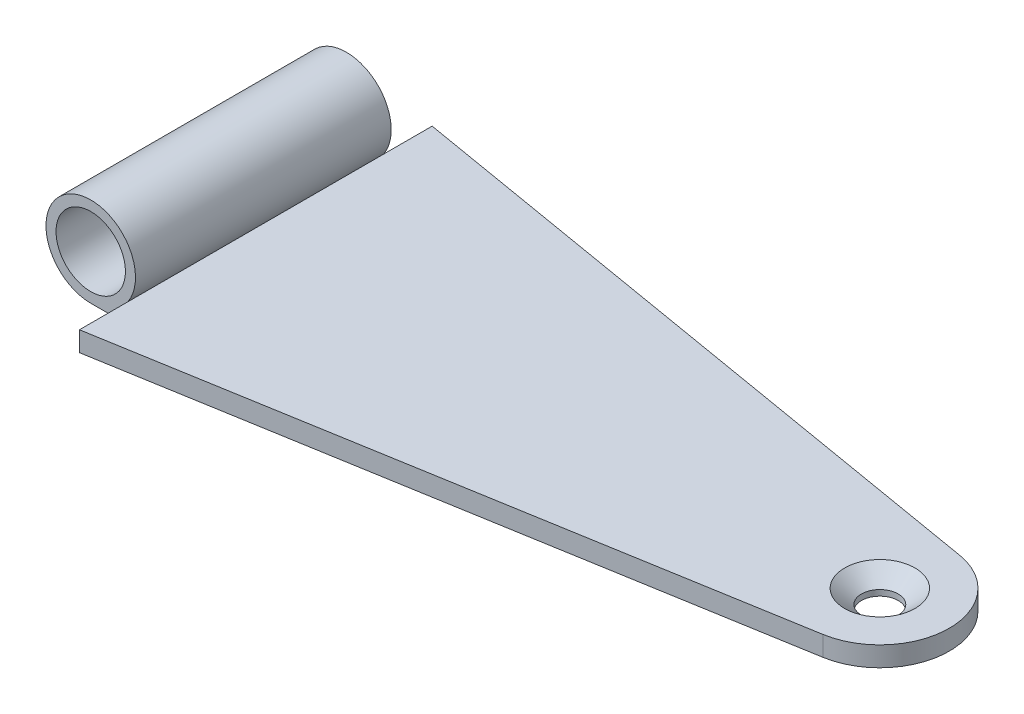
ISO-10303-21;
HEADER;
FILE_DESCRIPTION(('STEP AP214'),'2;1');
FILE_NAME('part.step','',(''),(''),'','','');
FILE_SCHEMA(('AUTOMOTIVE_DESIGN { 1 0 10303 214 1 1 1 1 }'));
ENDSEC;
DATA;
#1=APPLICATION_CONTEXT('core data for automotive mechanical design processes');
#2=APPLICATION_PROTOCOL_DEFINITION('international standard','automotive_design',2000,#1);
#3=PRODUCT_CONTEXT('',#1,'mechanical');
#4=PRODUCT('Part','Part','',(#3));
#5=PRODUCT_RELATED_PRODUCT_CATEGORY('part','',(#4));
#6=PRODUCT_DEFINITION_FORMATION('','',#4);
#7=PRODUCT_DEFINITION_CONTEXT('part definition',#1,'design');
#8=PRODUCT_DEFINITION('design','',#6,#7);
#9=PRODUCT_DEFINITION_SHAPE('','',#8);
#10=(LENGTH_UNIT() NAMED_UNIT(*) SI_UNIT(.MILLI.,.METRE.));
#11=(NAMED_UNIT(*) PLANE_ANGLE_UNIT() SI_UNIT($,.RADIAN.));
#12=(NAMED_UNIT(*) SI_UNIT($,.STERADIAN.) SOLID_ANGLE_UNIT());
#13=UNCERTAINTY_MEASURE_WITH_UNIT(LENGTH_MEASURE(1.E-05),#10,'distance_accuracy_value','');
#14=(GEOMETRIC_REPRESENTATION_CONTEXT(3) GLOBAL_UNCERTAINTY_ASSIGNED_CONTEXT((#13)) GLOBAL_UNIT_ASSIGNED_CONTEXT((#10,
#11,#12)) REPRESENTATION_CONTEXT('',''));
#15=CARTESIAN_POINT('',(0.,0.,0.));
#16=DIRECTION('',(0.,0.,1.));
#17=DIRECTION('',(1.,0.,0.));
#18=AXIS2_PLACEMENT_3D('',#15,#16,#17);
#19=CARTESIAN_POINT('',(91.948,0.,0.));
#20=DIRECTION('',(0.,-1.,0.));
#21=DIRECTION('',(0.,0.,-1.));
#22=AXIS2_PLACEMENT_3D('',#19,#20,#21);
#23=PLANE('',#22);
#24=CARTESIAN_POINT('',(91.948,0.,0.));
#25=DIRECTION('',(0.,1.,0.));
#26=DIRECTION('',(0.,0.,1.));
#27=AXIS2_PLACEMENT_3D('',#24,#25,#26);
#28=CIRCLE('',#27,4.88950000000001);
#29=CARTESIAN_POINT('',(91.948,0.,4.8895));
#30=VERTEX_POINT('',#29);
#31=EDGE_CURVE('E182',#30,#30,#28,.T.);
#32=ORIENTED_EDGE('',*,*,#31,.F.);
#33=EDGE_LOOP('',(#32));
#34=FACE_BOUND('',#33,.T.);
#35=DIRECTION('',(0.,0.,1.));
#36=VECTOR('',#35,1.);
#37=CARTESIAN_POINT('',(5.17177029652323,0.,-17.78));
#38=LINE('',#37,#36);
#39=CARTESIAN_POINT('',(5.17177029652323,0.,-17.78));
#40=VERTEX_POINT('',#39);
#41=CARTESIAN_POINT('',(5.17177029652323,0.,17.78));
#42=VERTEX_POINT('',#41);
#43=EDGE_CURVE('E49',#40,#42,#38,.T.);
#44=ORIENTED_EDGE('',*,*,#43,.T.);
#45=DIRECTION('',(0.,0.,-1.));
#46=VECTOR('',#45,1.);
#47=CARTESIAN_POINT('',(5.17177029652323,0.,17.78));
#48=LINE('',#47,#46);
#49=CARTESIAN_POINT('',(5.17177029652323,0.,24.521995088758));
#50=VERTEX_POINT('',#49);
#51=EDGE_CURVE('E122',#50,#42,#48,.T.);
#52=ORIENTED_EDGE('',*,*,#51,.F.);
#53=DIRECTION('',(0.985893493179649,0.,-0.16737389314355));
#54=VECTOR('',#53,1.);
#55=CARTESIAN_POINT('',(0.,0.,25.4));
#56=LINE('',#55,#54);
#57=CARTESIAN_POINT('',(93.5634928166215,0.,9.51584399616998));
#58=VERTEX_POINT('',#57);
#59=EDGE_CURVE('E69',#50,#58,#56,.T.);
#60=ORIENTED_EDGE('',*,*,#59,.T.);
#61=CARTESIAN_POINT('',(91.948,0.,0.));
#62=DIRECTION('',(0.,1.,0.));
#63=DIRECTION('',(0.,0.,-1.));
#64=AXIS2_PLACEMENT_3D('',#61,#62,#63);
#65=CIRCLE('',#64,9.65200000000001);
#66=CARTESIAN_POINT('',(93.5634928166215,0.,-9.51584399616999));
#67=VERTEX_POINT('',#66);
#68=EDGE_CURVE('E137',#58,#67,#65,.T.);
#69=ORIENTED_EDGE('',*,*,#68,.T.);
#70=DIRECTION('',(-0.98589349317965,0.,-0.167373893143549));
#71=VECTOR('',#70,1.);
#72=CARTESIAN_POINT('',(93.5634928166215,0.,-9.51584399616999));
#73=LINE('',#72,#71);
#74=CARTESIAN_POINT('',(5.17177029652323,0.,-24.521995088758));
#75=VERTEX_POINT('',#74);
#76=EDGE_CURVE('E141',#67,#75,#73,.T.);
#77=ORIENTED_EDGE('',*,*,#76,.T.);
#78=DIRECTION('',(0.,0.,-1.));
#79=VECTOR('',#78,1.);
#80=CARTESIAN_POINT('',(5.17177029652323,0.,-24.521995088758));
#81=LINE('',#80,#79);
#82=EDGE_CURVE('E92',#40,#75,#81,.T.);
#83=ORIENTED_EDGE('',*,*,#82,.F.);
#84=EDGE_LOOP('',(#44,#52,#60,#69,#77,#83));
#85=FACE_BOUND('',#84,.T.);
#86=ADVANCED_FACE('F40',(#34,#85),#23,.F.);
#87=CARTESIAN_POINT('',(93.5634928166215,-2.762,-9.51584399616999));
#88=DIRECTION('',(0.167373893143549,0.,-0.98589349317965));
#89=DIRECTION('',(-0.98589349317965,0.,-0.167373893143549));
#90=AXIS2_PLACEMENT_3D('',#87,#88,#89);
#91=PLANE('',#90);
#92=DIRECTION('',(0.,1.,0.));
#93=VECTOR('',#92,1.);
#94=CARTESIAN_POINT('',(5.17177029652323,-2.762,-24.521995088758));
#95=LINE('',#94,#93);
#96=CARTESIAN_POINT('',(5.17177029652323,-2.762,-24.521995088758));
#97=VERTEX_POINT('',#96);
#98=EDGE_CURVE('E165',#97,#75,#95,.T.);
#99=ORIENTED_EDGE('',*,*,#98,.T.);
#100=ORIENTED_EDGE('',*,*,#76,.F.);
#101=DIRECTION('',(0.,1.,0.));
#102=VECTOR('',#101,1.);
#103=CARTESIAN_POINT('',(93.5634928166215,-2.762,-9.51584399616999));
#104=LINE('',#103,#102);
#105=CARTESIAN_POINT('',(93.5634928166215,-2.762,-9.51584399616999));
#106=VERTEX_POINT('',#105);
#107=EDGE_CURVE('E57',#106,#67,#104,.T.);
#108=ORIENTED_EDGE('',*,*,#107,.F.);
#109=DIRECTION('',(-0.98589349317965,0.,-0.167373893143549));
#110=VECTOR('',#109,1.);
#111=CARTESIAN_POINT('',(93.5634928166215,-2.762,-9.51584399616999));
#112=LINE('',#111,#110);
#113=EDGE_CURVE('E133',#106,#97,#112,.T.);
#114=ORIENTED_EDGE('',*,*,#113,.T.);
#115=EDGE_LOOP('',(#99,#100,#108,#114));
#116=FACE_BOUND('',#115,.T.);
#117=ADVANCED_FACE('F42',(#116),#91,.T.);
#118=CARTESIAN_POINT('',(91.948,-2.762,0.));
#119=DIRECTION('',(0.,1.,0.));
#120=DIRECTION('',(0.,0.,1.));
#121=AXIS2_PLACEMENT_3D('',#118,#119,#120);
#122=CYLINDRICAL_SURFACE('',#121,9.65200000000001);
#123=ORIENTED_EDGE('',*,*,#68,.F.);
#124=DIRECTION('',(0.,1.,0.));
#125=VECTOR('',#124,1.);
#126=CARTESIAN_POINT('',(93.5634928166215,-2.762,9.51584399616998));
#127=LINE('',#126,#125);
#128=CARTESIAN_POINT('',(93.5634928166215,-2.762,9.51584399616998));
#129=VERTEX_POINT('',#128);
#130=EDGE_CURVE('E135',#129,#58,#127,.T.);
#131=ORIENTED_EDGE('',*,*,#130,.F.);
#132=CARTESIAN_POINT('',(91.948,-2.762,0.));
#133=DIRECTION('',(0.,1.,0.));
#134=DIRECTION('',(0.,0.,-1.));
#135=AXIS2_PLACEMENT_3D('',#132,#133,#134);
#136=CIRCLE('',#135,9.65200000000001);
#137=EDGE_CURVE('E132',#129,#106,#136,.T.);
#138=ORIENTED_EDGE('',*,*,#137,.T.);
#139=ORIENTED_EDGE('',*,*,#107,.T.);
#140=EDGE_LOOP('',(#123,#131,#138,#139));
#141=FACE_BOUND('',#140,.T.);
#142=ADVANCED_FACE('F193',(#141),#122,.T.);
#143=CARTESIAN_POINT('',(0.,-2.762,25.4));
#144=DIRECTION('',(0.16737389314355,0.,0.98589349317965));
#145=DIRECTION('',(0.98589349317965,0.,-0.16737389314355));
#146=AXIS2_PLACEMENT_3D('',#143,#144,#145);
#147=PLANE('',#146);
#148=DIRECTION('',(0.,1.,0.));
#149=VECTOR('',#148,1.);
#150=CARTESIAN_POINT('',(5.17177029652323,-2.762,24.521995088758));
#151=LINE('',#150,#149);
#152=CARTESIAN_POINT('',(5.17177029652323,-2.762,24.521995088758));
#153=VERTEX_POINT('',#152);
#154=EDGE_CURVE('E116',#153,#50,#151,.T.);
#155=ORIENTED_EDGE('',*,*,#154,.F.);
#156=DIRECTION('',(0.985893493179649,0.,-0.16737389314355));
#157=VECTOR('',#156,1.);
#158=CARTESIAN_POINT('',(0.,-2.762,25.4));
#159=LINE('',#158,#157);
#160=EDGE_CURVE('E126',#153,#129,#159,.T.);
#161=ORIENTED_EDGE('',*,*,#160,.T.);
#162=ORIENTED_EDGE('',*,*,#130,.T.);
#163=ORIENTED_EDGE('',*,*,#59,.F.);
#164=EDGE_LOOP('',(#155,#161,#162,#163));
#165=FACE_BOUND('',#164,.T.);
#166=ADVANCED_FACE('F125',(#165),#147,.T.);
#167=CARTESIAN_POINT('',(91.948,-2.762,0.));
#168=DIRECTION('',(0.,-1.,0.));
#169=DIRECTION('',(0.,0.,-1.));
#170=AXIS2_PLACEMENT_3D('',#167,#168,#169);
#171=PLANE('',#170);
#172=CARTESIAN_POINT('',(91.948,-2.762,0.));
#173=DIRECTION('',(0.,1.,0.));
#174=DIRECTION('',(0.,0.,1.));
#175=AXIS2_PLACEMENT_3D('',#172,#173,#174);
#176=CIRCLE('',#175,2.55270000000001);
#177=CARTESIAN_POINT('',(91.948,-2.762,2.5527));
#178=VERTEX_POINT('',#177);
#179=EDGE_CURVE('E175',#178,#178,#176,.T.);
#180=ORIENTED_EDGE('',*,*,#179,.T.);
#181=EDGE_LOOP('',(#180));
#182=FACE_BOUND('',#181,.T.);
#183=DIRECTION('',(-1.,0.,0.));
#184=VECTOR('',#183,1.);
#185=CARTESIAN_POINT('',(5.17177029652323,-2.762,17.78));
#186=LINE('',#185,#184);
#187=CARTESIAN_POINT('',(5.17177029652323,-2.762,17.78));
#188=VERTEX_POINT('',#187);
#189=CARTESIAN_POINT('',(0.,-2.762,17.78));
#190=VERTEX_POINT('',#189);
#191=EDGE_CURVE('E121',#188,#190,#186,.T.);
#192=ORIENTED_EDGE('',*,*,#191,.T.);
#193=DIRECTION('',(0.,0.,1.));
#194=VECTOR('',#193,1.);
#195=CARTESIAN_POINT('',(0.,-2.762,-17.78));
#196=LINE('',#195,#194);
#197=CARTESIAN_POINT('',(0.,-2.762,-17.78));
#198=VERTEX_POINT('',#197);
#199=EDGE_CURVE('E144',#198,#190,#196,.T.);
#200=ORIENTED_EDGE('',*,*,#199,.F.);
#201=DIRECTION('',(1.,0.,0.));
#202=VECTOR('',#201,1.);
#203=CARTESIAN_POINT('',(0.,-2.762,-17.78));
#204=LINE('',#203,#202);
#205=CARTESIAN_POINT('',(5.17177029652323,-2.762,-17.78));
#206=VERTEX_POINT('',#205);
#207=EDGE_CURVE('E78',#198,#206,#204,.T.);
#208=ORIENTED_EDGE('',*,*,#207,.T.);
#209=DIRECTION('',(0.,0.,-1.));
#210=VECTOR('',#209,1.);
#211=CARTESIAN_POINT('',(5.17177029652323,-2.762,-24.521995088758));
#212=LINE('',#211,#210);
#213=EDGE_CURVE('E167',#206,#97,#212,.T.);
#214=ORIENTED_EDGE('',*,*,#213,.T.);
#215=ORIENTED_EDGE('',*,*,#113,.F.);
#216=ORIENTED_EDGE('',*,*,#137,.F.);
#217=ORIENTED_EDGE('',*,*,#160,.F.);
#218=DIRECTION('',(0.,0.,-1.));
#219=VECTOR('',#218,1.);
#220=CARTESIAN_POINT('',(5.17177029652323,-2.762,17.78));
#221=LINE('',#220,#219);
#222=EDGE_CURVE('E112',#153,#188,#221,.T.);
#223=ORIENTED_EDGE('',*,*,#222,.T.);
#224=EDGE_LOOP('',(#192,#200,#208,#214,#215,#216,#217,#223));
#225=FACE_BOUND('',#224,.T.);
#226=ADVANCED_FACE('F130',(#182,#225),#171,.T.);
#227=CARTESIAN_POINT('',(0.,3.461,-17.78));
#228=DIRECTION('',(0.,0.,1.));
#229=DIRECTION('',(1.,0.,0.));
#230=AXIS2_PLACEMENT_3D('',#227,#228,#229);
#231=CYLINDRICAL_SURFACE('',#230,6.223);
#232=CARTESIAN_POINT('',(0.,3.461,-17.78));
#233=DIRECTION('',(0.,0.,1.));
#234=DIRECTION('',(1.,0.,0.));
#235=AXIS2_PLACEMENT_3D('',#232,#233,#234);
#236=CIRCLE('',#235,6.223);
#237=EDGE_CURVE('E154',#40,#198,#236,.T.);
#238=ORIENTED_EDGE('',*,*,#237,.T.);
#239=ORIENTED_EDGE('',*,*,#199,.T.);
#240=CARTESIAN_POINT('',(0.,3.461,17.78));
#241=DIRECTION('',(0.,0.,1.));
#242=DIRECTION('',(1.,0.,0.));
#243=AXIS2_PLACEMENT_3D('',#240,#241,#242);
#244=CIRCLE('',#243,6.223);
#245=EDGE_CURVE('E157',#42,#190,#244,.T.);
#246=ORIENTED_EDGE('',*,*,#245,.F.);
#247=ORIENTED_EDGE('',*,*,#43,.F.);
#248=EDGE_LOOP('',(#238,#239,#246,#247));
#249=FACE_BOUND('',#248,.T.);
#250=ADVANCED_FACE('F152',(#249),#231,.T.);
#251=CARTESIAN_POINT('',(0.,3.461,-17.78));
#252=DIRECTION('',(0.,0.,1.));
#253=DIRECTION('',(1.,0.,0.));
#254=AXIS2_PLACEMENT_3D('',#251,#252,#253);
#255=PLANE('',#254);
#256=CARTESIAN_POINT('',(0.,3.461,-17.78));
#257=DIRECTION('',(0.,0.,1.));
#258=DIRECTION('',(1.,0.,0.));
#259=AXIS2_PLACEMENT_3D('',#256,#257,#258);
#260=CIRCLE('',#259,4.826);
#261=CARTESIAN_POINT('',(4.826,3.461,-17.78));
#262=VERTEX_POINT('',#261);
#263=EDGE_CURVE('E160',#262,#262,#260,.F.);
#264=ORIENTED_EDGE('',*,*,#263,.F.);
#265=EDGE_LOOP('',(#264));
#266=FACE_BOUND('',#265,.T.);
#267=ORIENTED_EDGE('',*,*,#237,.F.);
#268=DIRECTION('',(0.,1.,0.));
#269=VECTOR('',#268,1.);
#270=CARTESIAN_POINT('',(5.17177029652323,-2.762,-17.78));
#271=LINE('',#270,#269);
#272=EDGE_CURVE('E94',#206,#40,#271,.T.);
#273=ORIENTED_EDGE('',*,*,#272,.F.);
#274=ORIENTED_EDGE('',*,*,#207,.F.);
#275=EDGE_LOOP('',(#267,#273,#274));
#276=FACE_BOUND('',#275,.T.);
#277=ADVANCED_FACE('F158',(#266,#276),#255,.F.);
#278=CARTESIAN_POINT('',(0.,3.461,17.78));
#279=DIRECTION('',(0.,0.,1.));
#280=DIRECTION('',(1.,0.,0.));
#281=AXIS2_PLACEMENT_3D('',#278,#279,#280);
#282=PLANE('',#281);
#283=CARTESIAN_POINT('',(0.,3.461,17.78));
#284=DIRECTION('',(0.,0.,1.));
#285=DIRECTION('',(1.,0.,0.));
#286=AXIS2_PLACEMENT_3D('',#283,#284,#285);
#287=CIRCLE('',#286,4.826);
#288=CARTESIAN_POINT('',(4.826,3.461,17.78));
#289=VERTEX_POINT('',#288);
#290=EDGE_CURVE('E11',#289,#289,#287,.T.);
#291=ORIENTED_EDGE('',*,*,#290,.F.);
#292=EDGE_LOOP('',(#291));
#293=FACE_BOUND('',#292,.T.);
#294=ORIENTED_EDGE('',*,*,#245,.T.);
#295=ORIENTED_EDGE('',*,*,#191,.F.);
#296=DIRECTION('',(0.,1.,0.));
#297=VECTOR('',#296,1.);
#298=CARTESIAN_POINT('',(5.17177029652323,-2.762,17.78));
#299=LINE('',#298,#297);
#300=EDGE_CURVE('E117',#188,#42,#299,.T.);
#301=ORIENTED_EDGE('',*,*,#300,.T.);
#302=EDGE_LOOP('',(#294,#295,#301));
#303=FACE_BOUND('',#302,.T.);
#304=ADVANCED_FACE('F228',(#293,#303),#282,.T.);
#305=CARTESIAN_POINT('',(0.,3.461,-31.4299893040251));
#306=DIRECTION('',(0.,0.,1.));
#307=DIRECTION('',(1.,0.,0.));
#308=AXIS2_PLACEMENT_3D('',#305,#306,#307);
#309=CYLINDRICAL_SURFACE('',#308,4.826);
#310=ORIENTED_EDGE('',*,*,#263,.T.);
#311=EDGE_LOOP('',(#310));
#312=FACE_BOUND('',#311,.T.);
#313=ORIENTED_EDGE('',*,*,#290,.T.);
#314=EDGE_LOOP('',(#313));
#315=FACE_BOUND('',#314,.T.);
#316=ADVANCED_FACE('F225',(#312,#315),#309,.F.);
#317=CARTESIAN_POINT('',(5.17177029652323,-2.762,-24.521995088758));
#318=DIRECTION('',(1.,0.,0.));
#319=DIRECTION('',(0.,0.,-1.));
#320=AXIS2_PLACEMENT_3D('',#317,#318,#319);
#321=PLANE('',#320);
#322=ORIENTED_EDGE('',*,*,#82,.T.);
#323=ORIENTED_EDGE('',*,*,#98,.F.);
#324=ORIENTED_EDGE('',*,*,#213,.F.);
#325=ORIENTED_EDGE('',*,*,#272,.T.);
#326=EDGE_LOOP('',(#322,#323,#324,#325));
#327=FACE_BOUND('',#326,.T.);
#328=ADVANCED_FACE('F222',(#327),#321,.F.);
#329=CARTESIAN_POINT('',(5.17177029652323,-2.762,17.78));
#330=DIRECTION('',(1.,0.,0.));
#331=DIRECTION('',(0.,0.,-1.));
#332=AXIS2_PLACEMENT_3D('',#329,#330,#331);
#333=PLANE('',#332);
#334=ORIENTED_EDGE('',*,*,#51,.T.);
#335=ORIENTED_EDGE('',*,*,#300,.F.);
#336=ORIENTED_EDGE('',*,*,#222,.F.);
#337=ORIENTED_EDGE('',*,*,#154,.T.);
#338=EDGE_LOOP('',(#334,#335,#336,#337));
#339=FACE_BOUND('',#338,.T.);
#340=ADVANCED_FACE('F115',(#339),#333,.F.);
#341=CARTESIAN_POINT('',(91.948,0.,0.));
#342=DIRECTION('',(0.,1.,0.));
#343=DIRECTION('',(0.,0.,1.));
#344=AXIS2_PLACEMENT_3D('',#341,#342,#343);
#345=CYLINDRICAL_SURFACE('',#344,2.5527);
#346=ORIENTED_EDGE('',*,*,#179,.F.);
#347=EDGE_LOOP('',(#346));
#348=FACE_BOUND('',#347,.T.);
#349=CARTESIAN_POINT('',(91.948,-1.96080801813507,0.));
#350=DIRECTION('',(0.,1.,0.));
#351=DIRECTION('',(0.,0.,1.));
#352=AXIS2_PLACEMENT_3D('',#349,#350,#351);
#353=CIRCLE('',#352,2.55269999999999);
#354=CARTESIAN_POINT('',(91.948,-1.96080801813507,2.55269999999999));
#355=VERTEX_POINT('',#354);
#356=EDGE_CURVE('E179',#355,#355,#353,.T.);
#357=ORIENTED_EDGE('',*,*,#356,.T.);
#358=EDGE_LOOP('',(#357));
#359=FACE_BOUND('',#358,.T.);
#360=ADVANCED_FACE('F209',(#348,#359),#345,.F.);
#361=CARTESIAN_POINT('',(91.948,0.,0.));
#362=DIRECTION('',(0.,1.,0.));
#363=DIRECTION('',(0.,0.,1.));
#364=AXIS2_PLACEMENT_3D('',#361,#362,#363);
#365=CONICAL_SURFACE('',#364,4.88950000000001,0.872664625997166);
#366=ORIENTED_EDGE('',*,*,#356,.F.);
#367=EDGE_LOOP('',(#366));
#368=FACE_BOUND('',#367,.T.);
#369=ORIENTED_EDGE('',*,*,#31,.T.);
#370=EDGE_LOOP('',(#369));
#371=FACE_BOUND('',#370,.T.);
#372=ADVANCED_FACE('F186',(#368,#371),#365,.F.);
#373=CLOSED_SHELL('',(#86,#117,#142,#166,#226,#250,#277,#304,#316,#328,#340,#360,#372));
#374=MANIFOLD_SOLID_BREP('B2',#373);
#375=ADVANCED_BREP_SHAPE_REPRESENTATION('',(#18,#374),#14);
#376=SHAPE_DEFINITION_REPRESENTATION(#9,#375);
ENDSEC;
END-ISO-10303-21;
